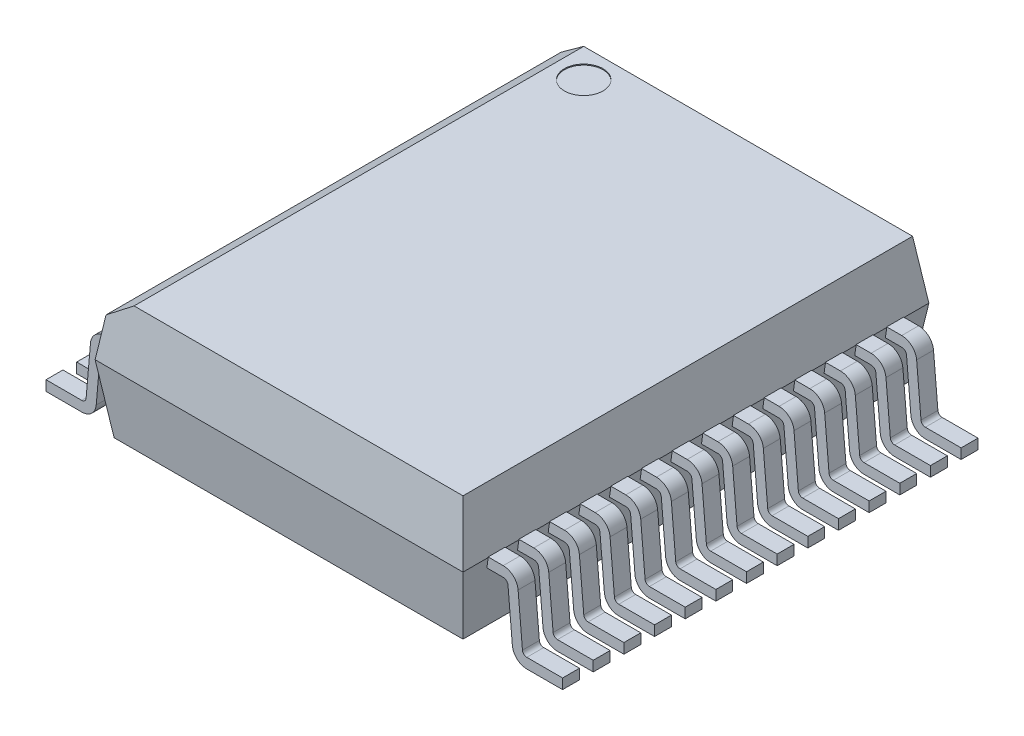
from build123d import *

# Parameters (mm, degrees)
EXTRUDE_1_DEPTH              = 0.175
SKETCH_9815_W                = 7.62
SKETCH_9815_H                = 9.65
EXTRUDE_9873_DEPTH           = 1.2
EXTRUDE_9873_TAPER           = 8
EXTRUDE_9873_OTHER_WAY_DEPTH = 1.4
EXTRUDE_9873_OTHER_WAY_TAPER = 8
PATTERN_LINEAR_9952_COUNT    = 14
PATTERN_LINEAR_9952_PITCH    = 0.635
CHAMFER_1_SIZE               = 0.4
CHAMFER_1_SIZE2              = 0.469982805
SKETCH_3_R                   = 0.4
CUT_EXTRUDE_3_DEPTH          = 0.02


with BuildPart() as part:
    # Sketch 1 → Extrude 1 (new, symmetric)
    with BuildSketch(Plane.XY.offset(-4.1275)):
        with BuildLine():
            Line((-5.35, 0), (-4.608899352, 0))
            ThreePointArc((-4.608899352, 0), (-4.40622229, 0.078816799), (-4.310040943, 0.273853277))
            Line((-4.310040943, 0.273853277), (-4.219502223, 1.308715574))
            ThreePointArc((-4.219502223, 1.308715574), (-4.187441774, 1.373727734), (-4.119882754, 1.4))
            Line((-4.119882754, 1.4), (4.119882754, 1.4))
            ThreePointArc((4.119882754, 1.4), (4.187441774, 1.373727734), (4.219502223, 1.308715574))
            Line((4.219502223, 1.308715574), (4.310040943, 0.273853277))
            ThreePointArc((4.310040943, 0.273853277), (4.40622229, 0.078816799), (4.608899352, 0))
            Line((4.608899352, 0), (5.35, 0))
            Line((5.35, 0), (5.35, 0.21))
            Line((5.35, 0.21), (4.608899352, 0.21))
            ThreePointArc((4.608899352, 0.21), (4.548096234, 0.23364504), (4.519241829, 0.292155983))
            Line((4.519241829, 0.292155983), (4.42870311, 1.32701828))
            ThreePointArc((4.42870311, 1.32701828), (4.329315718, 1.528555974), (4.119882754, 1.61))
            Line((4.119882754, 1.61), (-4.119882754, 1.61))
            ThreePointArc((-4.119882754, 1.61), (-4.329315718, 1.528555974), (-4.42870311, 1.32701828))
            Line((-4.42870311, 1.32701828), (-4.519241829, 0.292155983))
            ThreePointArc((-4.519241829, 0.292155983), (-4.548096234, 0.23364504), (-4.608899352, 0.21))
            Line((-4.608899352, 0.21), (-5.35, 0.21))
            Line((-5.35, 0.21), (-5.35, 0))
        make_face()
    extrude_1 = extrude(amount=EXTRUDE_1_DEPTH, both=True)

    # Sketch 9815 → Extrude 9873 (add)
    with BuildSketch(Plane(origin=(0, 1.6, 0), x_dir=(1, 0, 0), z_dir=(0, 1, 0))):
        Rectangle(SKETCH_9815_W, SKETCH_9815_H)
    extrude(amount=EXTRUDE_9873_DEPTH, taper=EXTRUDE_9873_TAPER)

    # Sketch 9815 → Extrude 9873 other way (add)
    with BuildSketch(Plane(origin=(0, 1.6, 0), x_dir=(1, 0, 0), z_dir=(0, 1, 0))):
        Rectangle(SKETCH_9815_W, SKETCH_9815_H)
    extrude(amount=-EXTRUDE_9873_OTHER_WAY_DEPTH, taper=EXTRUDE_9873_OTHER_WAY_TAPER)

    # Pattern Linear 9952: Extrude 1 ×14
    with Locations(*[(0, 0, i * PATTERN_LINEAR_9952_PITCH) for i in range(1, PATTERN_LINEAR_9952_COUNT)]):
        add(extrude_1)

    # Chamfer 1
    chamfer_1_edges = [part.edges().sort_by_distance(p)[0] for p in [
        (-3.641350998, 2.8, 0),
    ]]
    chamfer_1_side = [part.faces().sort_by_distance(p)[0] for p in [
        (-3.725815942, 2.199000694, 0),
    ]]
    chamfer(chamfer_1_edges, length=CHAMFER_1_SIZE, length2=CHAMFER_1_SIZE2, reference=chamfer_1_side[0])

    # Sketch 3 → Cut-Extrude 3 (cut)
    with BuildSketch(Plane(origin=(0, 2.8, 0), x_dir=(1, 0, 0), z_dir=(0, 1, 0))):
        with Locations(Location((-2.571368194, 4.056350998, 0), (0, 0, 270))):
            Circle(SKETCH_3_R)
    extrude(amount=-CUT_EXTRUDE_3_DEPTH, mode=Mode.SUBTRACT)


solid = part.part
